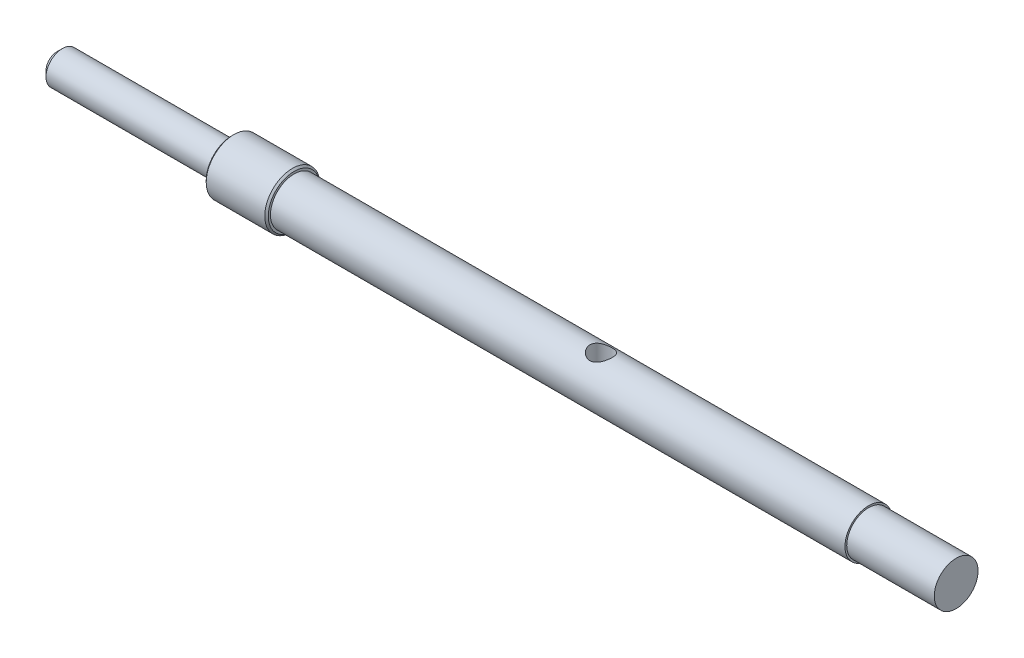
from build123d import *

# Parameters (mm, degrees)
CHAMFER1_SIZE       = 0.254
CHAMFER2_SIZE       = 0.79375
EXTRUDE1_DEPTH      = 106.195954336
EXTRUDE1_DEPTH_BACK = 106.195954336
SKETCH2_R           = 1.60655


with BuildPart() as part:
    # Sketch1 → Revolve1 (revolve)
    with BuildSketch(Plane.XY, mode=Mode.PRIVATE) as revolve1_sk:
        Polygon((0, 2.38125), (-25.4, 2.38125), (-25.4, 0), (0, 0), (105.0437574, 0), (105.0437574, 3.175), (92.3437574, 3.175), (92.3437574, 3.429), (9.0000074, 3.429), (9.0000074, 3.999865), (0, 3.999865), align=None)
    revolve(revolve1_sk.sketch.rotate(Axis((0, 0, 0), (1, 0, 0)), 90), axis=Axis((0, 0, 0), (1, 0, 0)))

    # Chamfer1
    chamfer1_edges = [part.edges().sort_by_distance(p)[0] for p in [
        (9.0000074, 0, -3.999865),
        (0, 0, -3.999865),
    ]]
    chamfer(chamfer1_edges, length=CHAMFER1_SIZE)

    # Chamfer2
    chamfer2_edges = [part.edges().sort_by_distance(p)[0] for p in [
        (-25.4, 0, -2.38125),
    ]]
    chamfer(chamfer2_edges, length=CHAMFER2_SIZE)

    # Sketch2 → Extrude1 (cut, two sides: drawn at the far end of the back side and taken through both)
    with BuildSketch(Plane(origin=(0, 0, 0), x_dir=(1, 0, 0), z_dir=(0, 1, 0)).offset(-EXTRUDE1_DEPTH_BACK)):
        with Locations(Location((53.5305, 0, 0), (0, 0, 270))):
            Circle(SKETCH2_R)
    extrude(amount=EXTRUDE1_DEPTH + EXTRUDE1_DEPTH_BACK, mode=Mode.SUBTRACT)


solid = part.part
